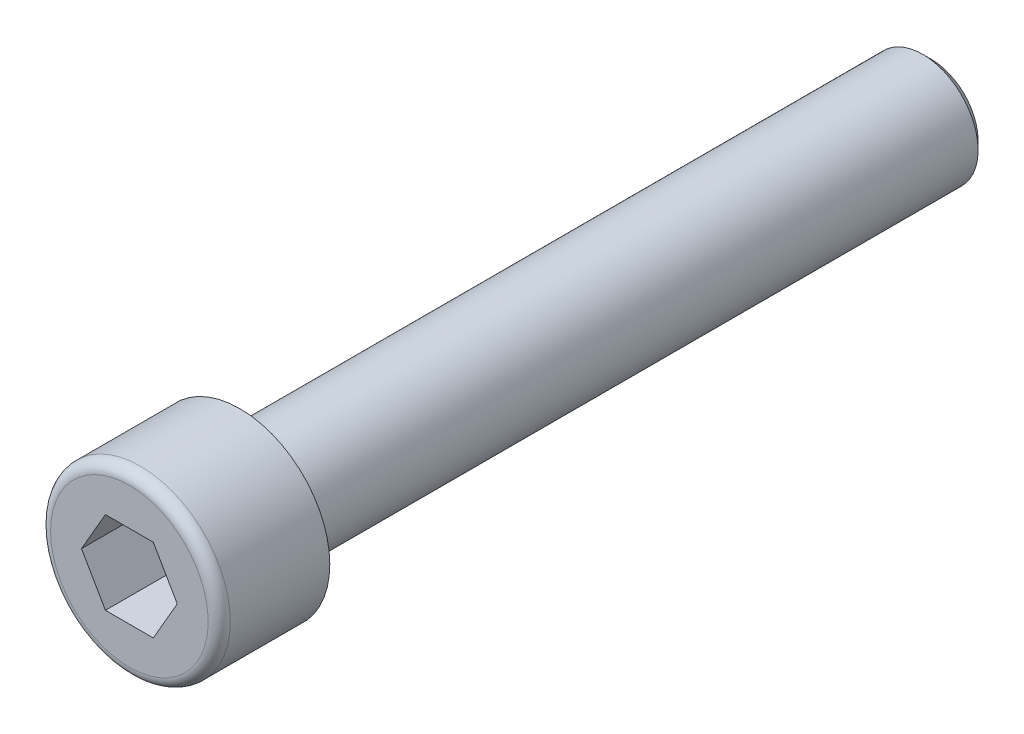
from build123d import *

# Parameters (mm, degrees)
ENL_V_MAT_EXTRU_1_DEPTH      = 5
ENL_V_MAT_EXTRU_1_DEPTH_BACK = 5


with BuildPart() as part:
    # Esquisse1 → R_volution1 (revolve)
    with BuildSketch(Plane(origin=(0, 0, 0), x_dir=(0, 0, -1), z_dir=(1, 0, 0)), mode=Mode.PRIVATE) as r_volution1_sk:
        with BuildLine():
            Line((-8, 0), (-8, 5.7))
            ThreePointArc((-8, 5.7), (-7.765685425, 6.265685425), (-7.2, 6.5))
            Line((-7.2, 6.5), (0, 6.5))
            Line((0, 6.5), (0, 4))
            Line((0, 4), (49.4, 4))
            Line((49.4, 4), (50, 3.4))
            Line((50, 3.4), (50, 0))
            Line((50, 0), (-8, 0))
        make_face()
    revolve(r_volution1_sk.sketch.rotate(Axis((0, 0, -50), (0, 0, 1)), 90), axis=Axis((0, 0, -50), (0, 0, 1)))

    # Esquisse2 → Enl_v. mat.-Extru.1 (cut, two sides: drawn at the far end of the back side and taken through both)
    with BuildSketch(Plane.XY.offset(8).offset(-ENL_V_MAT_EXTRU_1_DEPTH_BACK)):
        Polygon((-1.732050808, -3), (1.732050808, -3), (3.464101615, 0), (1.732050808, 3), (-1.732050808, 3), (-3.464101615, 0), align=None)
    extrude(amount=ENL_V_MAT_EXTRU_1_DEPTH + ENL_V_MAT_EXTRU_1_DEPTH_BACK, mode=Mode.SUBTRACT)


solid = part.part
